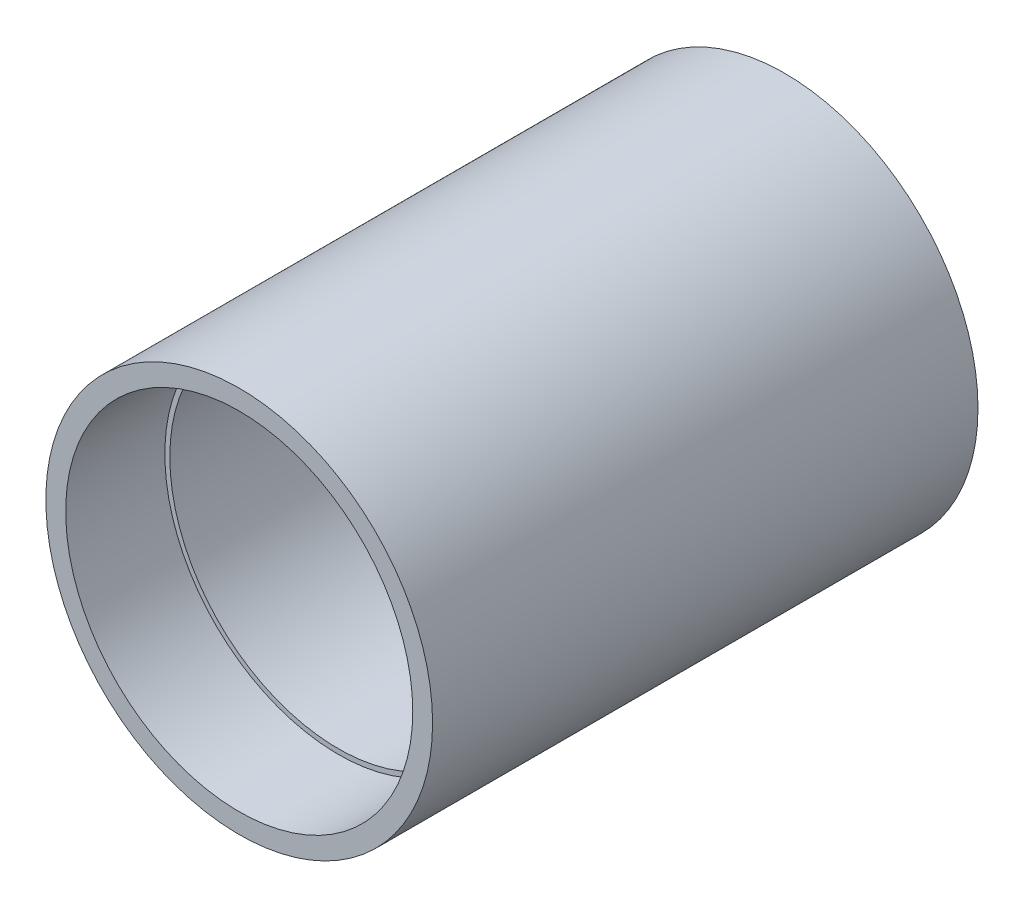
ISO-10303-21;
HEADER;
FILE_DESCRIPTION(('STEP AP214'),'2;1');
FILE_NAME('part.step','',(''),(''),'','','');
FILE_SCHEMA(('AUTOMOTIVE_DESIGN { 1 0 10303 214 1 1 1 1 }'));
ENDSEC;
DATA;
#1=APPLICATION_CONTEXT('core data for automotive mechanical design processes');
#2=APPLICATION_PROTOCOL_DEFINITION('international standard','automotive_design',2000,#1);
#3=PRODUCT_CONTEXT('',#1,'mechanical');
#4=PRODUCT('Part','Part','',(#3));
#5=PRODUCT_RELATED_PRODUCT_CATEGORY('part','',(#4));
#6=PRODUCT_DEFINITION_FORMATION('','',#4);
#7=PRODUCT_DEFINITION_CONTEXT('part definition',#1,'design');
#8=PRODUCT_DEFINITION('design','',#6,#7);
#9=PRODUCT_DEFINITION_SHAPE('','',#8);
#10=(LENGTH_UNIT() NAMED_UNIT(*) SI_UNIT(.MILLI.,.METRE.));
#11=(NAMED_UNIT(*) PLANE_ANGLE_UNIT() SI_UNIT($,.RADIAN.));
#12=(NAMED_UNIT(*) SI_UNIT($,.STERADIAN.) SOLID_ANGLE_UNIT());
#13=UNCERTAINTY_MEASURE_WITH_UNIT(LENGTH_MEASURE(1.E-05),#10,'distance_accuracy_value','');
#14=(GEOMETRIC_REPRESENTATION_CONTEXT(3) GLOBAL_UNCERTAINTY_ASSIGNED_CONTEXT((#13)) GLOBAL_UNIT_ASSIGNED_CONTEXT((#10,
#11,#12)) REPRESENTATION_CONTEXT('',''));
#15=CARTESIAN_POINT('',(0.,0.,0.));
#16=DIRECTION('',(0.,0.,1.));
#17=DIRECTION('',(1.,0.,0.));
#18=AXIS2_PLACEMENT_3D('',#15,#16,#17);
#19=CARTESIAN_POINT('',(0.,0.,55.));
#20=DIRECTION('',(0.,0.,-1.));
#21=DIRECTION('',(-1.,0.,0.));
#22=AXIS2_PLACEMENT_3D('',#19,#20,#21);
#23=CYLINDRICAL_SURFACE('',#22,17.);
#24=CARTESIAN_POINT('',(0.,0.,45.));
#25=DIRECTION('',(0.,0.,1.));
#26=DIRECTION('',(1.,0.,0.));
#27=AXIS2_PLACEMENT_3D('',#24,#25,#26);
#28=CIRCLE('',#27,17.);
#29=CARTESIAN_POINT('',(17.,0.,45.));
#30=VERTEX_POINT('',#29);
#31=EDGE_CURVE('E47',#30,#30,#28,.T.);
#32=ORIENTED_EDGE('',*,*,#31,.T.);
#33=EDGE_LOOP('',(#32));
#34=FACE_BOUND('',#33,.T.);
#35=CARTESIAN_POINT('',(0.,0.,10.));
#36=DIRECTION('',(0.,0.,-1.));
#37=DIRECTION('',(-1.,0.,0.));
#38=AXIS2_PLACEMENT_3D('',#35,#36,#37);
#39=CIRCLE('',#38,17.);
#40=CARTESIAN_POINT('',(-17.,0.,10.));
#41=VERTEX_POINT('',#40);
#42=EDGE_CURVE('E38',#41,#41,#39,.T.);
#43=ORIENTED_EDGE('',*,*,#42,.T.);
#44=EDGE_LOOP('',(#43));
#45=FACE_BOUND('',#44,.T.);
#46=ADVANCED_FACE('F34',(#34,#45),#23,.F.);
#47=CARTESIAN_POINT('',(0.,0.,55.));
#48=DIRECTION('',(0.,0.,1.));
#49=DIRECTION('',(1.,0.,0.));
#50=AXIS2_PLACEMENT_3D('',#47,#48,#49);
#51=PLANE('',#50);
#52=CARTESIAN_POINT('',(0.,0.,55.));
#53=DIRECTION('',(0.,0.,1.));
#54=DIRECTION('',(1.,0.,0.));
#55=AXIS2_PLACEMENT_3D('',#52,#53,#54);
#56=CIRCLE('',#55,17.5);
#57=CARTESIAN_POINT('',(17.5,0.,55.));
#58=VERTEX_POINT('',#57);
#59=EDGE_CURVE('E55',#58,#58,#56,.T.);
#60=ORIENTED_EDGE('',*,*,#59,.F.);
#61=EDGE_LOOP('',(#60));
#62=FACE_BOUND('',#61,.T.);
#63=CARTESIAN_POINT('',(0.,0.,55.));
#64=DIRECTION('',(0.,0.,1.));
#65=DIRECTION('',(1.,0.,0.));
#66=AXIS2_PLACEMENT_3D('',#63,#64,#65);
#67=CIRCLE('',#66,19.5);
#68=CARTESIAN_POINT('',(19.5,0.,55.));
#69=VERTEX_POINT('',#68);
#70=EDGE_CURVE('E10',#69,#69,#67,.T.);
#71=ORIENTED_EDGE('',*,*,#70,.T.);
#72=EDGE_LOOP('',(#71));
#73=FACE_BOUND('',#72,.T.);
#74=ADVANCED_FACE('F73',(#62,#73),#51,.T.);
#75=CARTESIAN_POINT('',(0.,0.,0.));
#76=DIRECTION('',(0.,0.,1.));
#77=DIRECTION('',(1.,0.,0.));
#78=AXIS2_PLACEMENT_3D('',#75,#76,#77);
#79=PLANE('',#78);
#80=CARTESIAN_POINT('',(0.,0.,0.));
#81=DIRECTION('',(0.,0.,-1.));
#82=DIRECTION('',(-1.,0.,0.));
#83=AXIS2_PLACEMENT_3D('',#80,#81,#82);
#84=CIRCLE('',#83,17.5);
#85=CARTESIAN_POINT('',(-17.5,0.,0.));
#86=VERTEX_POINT('',#85);
#87=EDGE_CURVE('E64',#86,#86,#84,.T.);
#88=ORIENTED_EDGE('',*,*,#87,.F.);
#89=EDGE_LOOP('',(#88));
#90=FACE_BOUND('',#89,.T.);
#91=CARTESIAN_POINT('',(0.,0.,0.));
#92=DIRECTION('',(0.,0.,1.));
#93=DIRECTION('',(1.,0.,0.));
#94=AXIS2_PLACEMENT_3D('',#91,#92,#93);
#95=CIRCLE('',#94,19.5);
#96=CARTESIAN_POINT('',(19.5,0.,0.));
#97=VERTEX_POINT('',#96);
#98=EDGE_CURVE('E42',#97,#97,#95,.T.);
#99=ORIENTED_EDGE('',*,*,#98,.F.);
#100=EDGE_LOOP('',(#99));
#101=FACE_BOUND('',#100,.T.);
#102=ADVANCED_FACE('F70',(#90,#101),#79,.F.);
#103=CARTESIAN_POINT('',(0.,0.,55.));
#104=DIRECTION('',(0.,0.,-1.));
#105=DIRECTION('',(-1.,0.,0.));
#106=AXIS2_PLACEMENT_3D('',#103,#104,#105);
#107=CYLINDRICAL_SURFACE('',#106,19.5);
#108=ORIENTED_EDGE('',*,*,#70,.F.);
#109=EDGE_LOOP('',(#108));
#110=FACE_BOUND('',#109,.T.);
#111=ORIENTED_EDGE('',*,*,#98,.T.);
#112=EDGE_LOOP('',(#111));
#113=FACE_BOUND('',#112,.T.);
#114=ADVANCED_FACE('F36',(#110,#113),#107,.T.);
#115=CARTESIAN_POINT('',(0.,0.,45.));
#116=DIRECTION('',(0.,0.,1.));
#117=DIRECTION('',(1.,0.,0.));
#118=AXIS2_PLACEMENT_3D('',#115,#116,#117);
#119=CYLINDRICAL_SURFACE('',#118,17.5);
#120=CARTESIAN_POINT('',(0.,0.,45.));
#121=DIRECTION('',(0.,0.,1.));
#122=DIRECTION('',(1.,0.,0.));
#123=AXIS2_PLACEMENT_3D('',#120,#121,#122);
#124=CIRCLE('',#123,17.5);
#125=CARTESIAN_POINT('',(17.5,0.,45.));
#126=VERTEX_POINT('',#125);
#127=EDGE_CURVE('E51',#126,#126,#124,.T.);
#128=ORIENTED_EDGE('',*,*,#127,.F.);
#129=EDGE_LOOP('',(#128));
#130=FACE_BOUND('',#129,.T.);
#131=ORIENTED_EDGE('',*,*,#59,.T.);
#132=EDGE_LOOP('',(#131));
#133=FACE_BOUND('',#132,.T.);
#134=ADVANCED_FACE('F78',(#130,#133),#119,.F.);
#135=CARTESIAN_POINT('',(0.,0.,45.));
#136=DIRECTION('',(0.,0.,1.));
#137=DIRECTION('',(1.,0.,0.));
#138=AXIS2_PLACEMENT_3D('',#135,#136,#137);
#139=PLANE('',#138);
#140=ORIENTED_EDGE('',*,*,#31,.F.);
#141=EDGE_LOOP('',(#140));
#142=FACE_BOUND('',#141,.T.);
#143=ORIENTED_EDGE('',*,*,#127,.T.);
#144=EDGE_LOOP('',(#143));
#145=FACE_BOUND('',#144,.T.);
#146=ADVANCED_FACE('F83',(#142,#145),#139,.T.);
#147=CARTESIAN_POINT('',(0.,0.,10.));
#148=DIRECTION('',(0.,0.,-1.));
#149=DIRECTION('',(-1.,0.,0.));
#150=AXIS2_PLACEMENT_3D('',#147,#148,#149);
#151=CYLINDRICAL_SURFACE('',#150,17.5);
#152=CARTESIAN_POINT('',(0.,0.,10.));
#153=DIRECTION('',(0.,0.,-1.));
#154=DIRECTION('',(-1.,0.,0.));
#155=AXIS2_PLACEMENT_3D('',#152,#153,#154);
#156=CIRCLE('',#155,17.5);
#157=CARTESIAN_POINT('',(-17.5,0.,10.));
#158=VERTEX_POINT('',#157);
#159=EDGE_CURVE('E61',#158,#158,#156,.T.);
#160=ORIENTED_EDGE('',*,*,#159,.F.);
#161=EDGE_LOOP('',(#160));
#162=FACE_BOUND('',#161,.T.);
#163=ORIENTED_EDGE('',*,*,#87,.T.);
#164=EDGE_LOOP('',(#163));
#165=FACE_BOUND('',#164,.T.);
#166=ADVANCED_FACE('F68',(#162,#165),#151,.F.);
#167=CARTESIAN_POINT('',(0.,0.,10.));
#168=DIRECTION('',(0.,0.,-1.));
#169=DIRECTION('',(-1.,0.,0.));
#170=AXIS2_PLACEMENT_3D('',#167,#168,#169);
#171=PLANE('',#170);
#172=ORIENTED_EDGE('',*,*,#42,.F.);
#173=EDGE_LOOP('',(#172));
#174=FACE_BOUND('',#173,.T.);
#175=ORIENTED_EDGE('',*,*,#159,.T.);
#176=EDGE_LOOP('',(#175));
#177=FACE_BOUND('',#176,.T.);
#178=ADVANCED_FACE('F99',(#174,#177),#171,.T.);
#179=CLOSED_SHELL('',(#46,#74,#102,#114,#134,#146,#166,#178));
#180=MANIFOLD_SOLID_BREP('B2',#179);
#181=ADVANCED_BREP_SHAPE_REPRESENTATION('',(#18,#180),#14);
#182=SHAPE_DEFINITION_REPRESENTATION(#9,#181);
ENDSEC;
END-ISO-10303-21;
